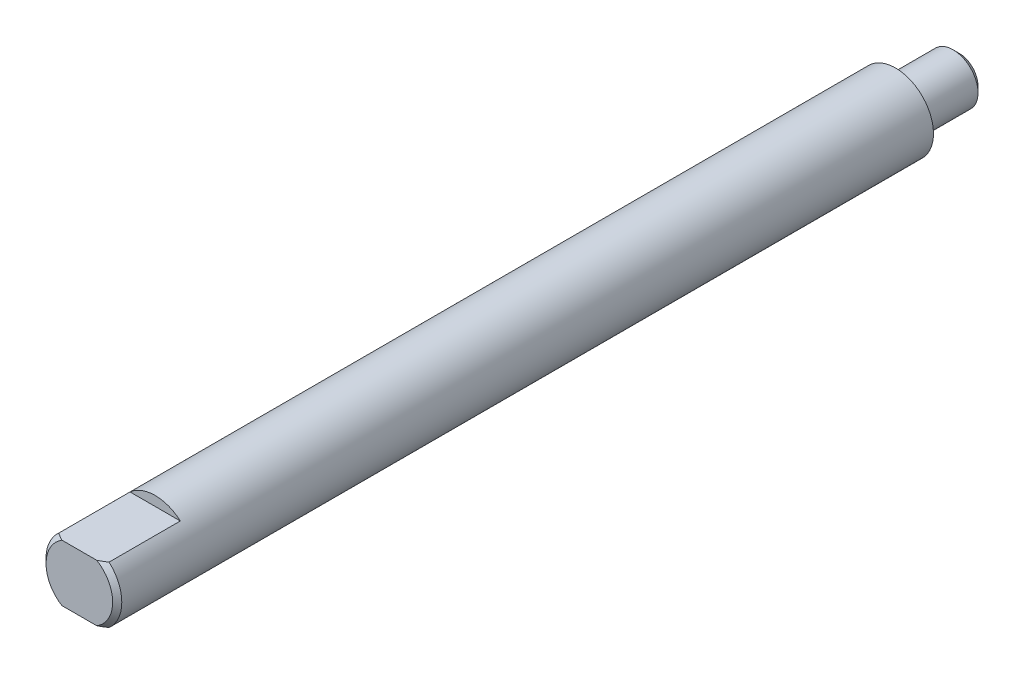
ISO-10303-21;
HEADER;
FILE_DESCRIPTION(('STEP AP214'),'2;1');
FILE_NAME('part.step','',(''),(''),'','','');
FILE_SCHEMA(('AUTOMOTIVE_DESIGN { 1 0 10303 214 1 1 1 1 }'));
ENDSEC;
DATA;
#1=APPLICATION_CONTEXT('core data for automotive mechanical design processes');
#2=APPLICATION_PROTOCOL_DEFINITION('international standard','automotive_design',2000,#1);
#3=PRODUCT_CONTEXT('',#1,'mechanical');
#4=PRODUCT('Part','Part','',(#3));
#5=PRODUCT_RELATED_PRODUCT_CATEGORY('part','',(#4));
#6=PRODUCT_DEFINITION_FORMATION('','',#4);
#7=PRODUCT_DEFINITION_CONTEXT('part definition',#1,'design');
#8=PRODUCT_DEFINITION('design','',#6,#7);
#9=PRODUCT_DEFINITION_SHAPE('','',#8);
#10=(LENGTH_UNIT() NAMED_UNIT(*) SI_UNIT(.MILLI.,.METRE.));
#11=(NAMED_UNIT(*) PLANE_ANGLE_UNIT() SI_UNIT($,.RADIAN.));
#12=(NAMED_UNIT(*) SI_UNIT($,.STERADIAN.) SOLID_ANGLE_UNIT());
#13=UNCERTAINTY_MEASURE_WITH_UNIT(LENGTH_MEASURE(1.E-05),#10,'distance_accuracy_value','');
#14=(GEOMETRIC_REPRESENTATION_CONTEXT(3) GLOBAL_UNCERTAINTY_ASSIGNED_CONTEXT((#13)) GLOBAL_UNIT_ASSIGNED_CONTEXT((#10,
#11,#12)) REPRESENTATION_CONTEXT('',''));
#15=CARTESIAN_POINT('',(0.,0.,0.));
#16=DIRECTION('',(0.,0.,1.));
#17=DIRECTION('',(1.,0.,0.));
#18=AXIS2_PLACEMENT_3D('',#15,#16,#17);
#19=CARTESIAN_POINT('',(0.,0.,3.684));
#20=DIRECTION('',(0.,0.,-1.));
#21=DIRECTION('',(0.,1.,0.));
#22=AXIS2_PLACEMENT_3D('',#19,#20,#21);
#23=CONICAL_SURFACE('',#22,3.175,0.791934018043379);
#24=CARTESIAN_POINT('',(0.,0.,3.684));
#25=DIRECTION('',(0.,0.,1.));
#26=DIRECTION('',(0.,-1.,0.));
#27=AXIS2_PLACEMENT_3D('',#24,#25,#26);
#28=CIRCLE('',#27,3.175);
#29=CARTESIAN_POINT('',(-2.10713075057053,2.37500000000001,3.684));
#30=VERTEX_POINT('',#29);
#31=CARTESIAN_POINT('',(-2.10713075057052,-2.37500000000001,3.684));
#32=VERTEX_POINT('',#31);
#33=EDGE_CURVE('E105',#30,#32,#28,.T.);
#34=ORIENTED_EDGE('',*,*,#33,.T.);
#35=CARTESIAN_POINT('',(-6.62966945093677,-2.37500000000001,-0.13301595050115));
#36=CARTESIAN_POINT('',(-6.41872085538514,-2.37500000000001,0.0629362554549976));
#37=CARTESIAN_POINT('',(-6.20729327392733,-2.37500000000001,0.258380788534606));
#38=CARTESIAN_POINT('',(-5.78286017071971,-2.37500000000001,0.647887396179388));
#39=CARTESIAN_POINT('',(-5.56985352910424,-2.37500000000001,0.84194824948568));
#40=CARTESIAN_POINT('',(-5.13574053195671,-2.37500000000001,1.23363349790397));
#41=CARTESIAN_POINT('',(-4.91457904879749,-2.37500000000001,1.43119690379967));
#42=CARTESIAN_POINT('',(-4.46963283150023,-2.37500000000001,1.82304516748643));
#43=CARTESIAN_POINT('',(-4.24585006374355,-2.37500000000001,2.0173322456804));
#44=CARTESIAN_POINT('',(-3.90719638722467,-2.37500000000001,2.30510248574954));
#45=CARTESIAN_POINT('',(-3.79385459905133,-2.37500000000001,2.40038380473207));
#46=CARTESIAN_POINT('',(-3.56590809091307,-2.37500000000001,2.58942155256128));
#47=CARTESIAN_POINT('',(-3.45130340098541,-2.37500000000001,2.68317801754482));
#48=CARTESIAN_POINT('',(-3.22025369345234,-2.37500000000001,2.8689546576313));
#49=CARTESIAN_POINT('',(-3.10380502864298,-2.37500000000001,2.96097030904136));
#50=CARTESIAN_POINT('',(-2.86892224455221,-2.37500000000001,3.14241965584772));
#51=CARTESIAN_POINT('',(-2.75048831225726,-2.37500000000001,3.23185359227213));
#52=CARTESIAN_POINT('',(-2.51255729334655,-2.37500000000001,3.40617108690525));
#53=CARTESIAN_POINT('',(-2.39309165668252,-2.37500000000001,3.49109735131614));
#54=CARTESIAN_POINT('',(-2.15090508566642,-2.37500000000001,3.656342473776));
#55=CARTESIAN_POINT('',(-2.02818269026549,-2.37500000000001,3.73665921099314));
#56=CARTESIAN_POINT('',(-1.77912466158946,-2.37500000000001,3.89039659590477));
#57=CARTESIAN_POINT('',(-1.65280524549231,-2.37500000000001,3.96384327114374));
#58=CARTESIAN_POINT('',(-1.39512518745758,-2.37500000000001,4.10119391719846));
#59=CARTESIAN_POINT('',(-1.26377071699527,-2.37500000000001,4.16510912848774));
#60=CARTESIAN_POINT('',(-1.05701971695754,-2.37500000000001,4.25273595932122));
#61=CARTESIAN_POINT('',(-0.983728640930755,-2.37500000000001,4.28140199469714));
#62=CARTESIAN_POINT('',(-0.835356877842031,-2.37500000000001,4.33377721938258));
#63=CARTESIAN_POINT('',(-0.760275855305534,-2.37500000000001,4.35748547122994));
#64=CARTESIAN_POINT('',(-0.608898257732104,-2.37500000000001,4.39885359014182));
#65=CARTESIAN_POINT('',(-0.532610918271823,-2.37500000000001,4.41654679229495));
#66=CARTESIAN_POINT('',(-0.378780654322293,-2.37500000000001,4.44515427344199));
#67=CARTESIAN_POINT('',(-0.301238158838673,-2.37500000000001,4.45607082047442));
#68=CARTESIAN_POINT('',(-0.144559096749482,-2.37500000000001,4.47054748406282));
#69=CARTESIAN_POINT('',(-0.0654144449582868,-2.37500000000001,4.47402190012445));
#70=CARTESIAN_POINT('',(0.0928249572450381,-2.37500000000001,4.47312081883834));
#71=CARTESIAN_POINT('',(0.171919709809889,-2.37500000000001,4.46874568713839));
#72=CARTESIAN_POINT('',(0.329626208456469,-2.37500000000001,4.45241265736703));
#73=CARTESIAN_POINT('',(0.408234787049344,-2.37500000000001,4.44042470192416));
#74=CARTESIAN_POINT('',(0.56408615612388,-2.37500000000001,4.40957980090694));
#75=CARTESIAN_POINT('',(0.641328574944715,-2.37500000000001,4.39072101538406));
#76=CARTESIAN_POINT('',(0.827865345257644,-2.37500000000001,4.33746225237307));
#77=CARTESIAN_POINT('',(0.936246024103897,-2.37500000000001,4.29987709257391));
#78=CARTESIAN_POINT('',(1.14927492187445,-2.37500000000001,4.21535984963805));
#79=CARTESIAN_POINT('',(1.25392057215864,-2.37500000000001,4.16842147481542));
#80=CARTESIAN_POINT('',(1.46087103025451,-2.37500000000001,4.06709514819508));
#81=CARTESIAN_POINT('',(1.56313950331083,-2.37500000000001,4.01263383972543));
#82=CARTESIAN_POINT('',(1.71427099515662,-2.37500000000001,3.92703840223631));
#83=CARTESIAN_POINT('',(1.76426245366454,-2.37500000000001,3.89786057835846));
#84=CARTESIAN_POINT('',(1.86356372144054,-2.37500000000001,3.83837009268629));
#85=CARTESIAN_POINT('',(1.91287355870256,-2.37500000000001,3.80805747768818));
#86=CARTESIAN_POINT('',(2.07522042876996,-2.37500000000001,3.70601224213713));
#87=CARTESIAN_POINT('',(2.18692206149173,-2.37500000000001,3.63215349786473));
#88=CARTESIAN_POINT('',(2.4077231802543,-2.37500000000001,3.48062951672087));
#89=CARTESIAN_POINT('',(2.51682205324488,-2.37500000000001,3.40296339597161));
#90=CARTESIAN_POINT('',(2.73301390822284,-2.37500000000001,3.24473477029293));
#91=CARTESIAN_POINT('',(2.84010537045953,-2.37500000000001,3.16417019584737));
#92=CARTESIAN_POINT('',(3.0526172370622,-2.37500000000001,3.00086187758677));
#93=CARTESIAN_POINT('',(3.15803753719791,-2.37500000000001,2.91811799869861));
#94=CARTESIAN_POINT('',(3.47300086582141,-2.37500000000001,2.66679989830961));
#95=CARTESIAN_POINT('',(3.68051445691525,-2.37500000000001,2.49568568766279));
#96=CARTESIAN_POINT('',(4.09182405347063,-2.37500000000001,2.14926116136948));
#97=CARTESIAN_POINT('',(4.2956216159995,-2.37500000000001,1.97395267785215));
#98=CARTESIAN_POINT('',(4.67931232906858,-2.37500000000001,1.63905531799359));
#99=CARTESIAN_POINT('',(4.85946034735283,-2.37500000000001,1.47975783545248));
#100=CARTESIAN_POINT('',(5.21824582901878,-2.37500000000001,1.15942835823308));
#101=CARTESIAN_POINT('',(5.39688309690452,-2.37500000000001,0.998396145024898));
#102=CARTESIAN_POINT('',(5.75173692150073,-2.37500000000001,0.676174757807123));
#103=CARTESIAN_POINT('',(5.92796166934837,-2.37500000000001,0.514994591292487));
#104=CARTESIAN_POINT('',(6.27946145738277,-2.37500000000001,0.191659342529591));
#105=CARTESIAN_POINT('',(6.45473664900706,-2.37500000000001,0.0295044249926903));
#106=CARTESIAN_POINT('',(6.62966945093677,-2.37500000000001,-0.133015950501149));
#107=B_SPLINE_CURVE_WITH_KNOTS('',3,(#35,#36,#37,#38,#39,#40,#41,#42,#43,#44,#45,#46,#47,#48,
#49,#50,#51,#52,#53,#54,#55,#56,#57,#58,#59,#60,#61,#62,#63,#64,#65,#66,#67,#68,#69,#70,#71,#72,
#73,#74,#75,#76,#77,#78,#79,#80,#81,#82,#83,#84,#85,#86,#87,#88,#89,#90,#91,#92,#93,#94,#95,#96,
#97,#98,#99,#100,#101,#102,#103,#104,#105,#106),.UNSPECIFIED.,.F.,.F.,(4,2,2,2,2,2,2,2,2,2,2,2,
2,2,2,2,2,2,2,2,2,2,2,2,2,2,2,2,2,2,2,2,2,2,2,4),(0.,0.863760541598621,1.72820709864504,
2.6178487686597,3.50686109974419,3.95106286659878,4.39525409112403,4.84047397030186,
5.28565214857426,5.72530383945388,6.16515621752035,6.60326828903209,7.04085953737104,
7.27681206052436,7.51280915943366,7.74747620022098,7.98206465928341,8.21934033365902,
8.45660495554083,8.69481223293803,8.93308334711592,9.27660606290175,9.62036064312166,
9.96774119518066,10.1413805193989,10.3150126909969,10.7166254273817,11.1183318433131,
11.5203310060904,11.9223551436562,12.7291420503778,13.535582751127,14.2569976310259,
14.9785044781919,15.6949553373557,16.4112883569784),.UNSPECIFIED.);
#108=CARTESIAN_POINT('',(-1.4640611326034,-2.37500000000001,4.064));
#109=VERTEX_POINT('',#108);
#110=EDGE_CURVE('E128',#32,#109,#107,.T.);
#111=ORIENTED_EDGE('',*,*,#110,.T.);
#112=CARTESIAN_POINT('',(0.,0.,4.064));
#113=DIRECTION('',(0.,0.,1.));
#114=DIRECTION('',(0.,-1.,0.));
#115=AXIS2_PLACEMENT_3D('',#112,#113,#114);
#116=CIRCLE('',#115,2.79);
#117=CARTESIAN_POINT('',(-1.4640611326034,2.37500000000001,4.064));
#118=VERTEX_POINT('',#117);
#119=EDGE_CURVE('E115',#118,#109,#116,.T.);
#120=ORIENTED_EDGE('',*,*,#119,.F.);
#121=CARTESIAN_POINT('',(6.62966945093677,2.37500000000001,-0.133015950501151));
#122=CARTESIAN_POINT('',(6.41872085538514,2.37500000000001,0.0629362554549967));
#123=CARTESIAN_POINT('',(6.20729327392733,2.37500000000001,0.258380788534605));
#124=CARTESIAN_POINT('',(5.78286017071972,2.37500000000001,0.647887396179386));
#125=CARTESIAN_POINT('',(5.56985352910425,2.37500000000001,0.841948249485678));
#126=CARTESIAN_POINT('',(5.13574053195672,2.37500000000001,1.23363349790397));
#127=CARTESIAN_POINT('',(4.9145790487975,2.37500000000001,1.43119690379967));
#128=CARTESIAN_POINT('',(4.46963283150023,2.37500000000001,1.82304516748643));
#129=CARTESIAN_POINT('',(4.24585006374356,2.37500000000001,2.0173322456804));
#130=CARTESIAN_POINT('',(3.90719638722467,2.37500000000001,2.30510248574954));
#131=CARTESIAN_POINT('',(3.79385459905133,2.37500000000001,2.40038380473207));
#132=CARTESIAN_POINT('',(3.56590809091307,2.37500000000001,2.58942155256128));
#133=CARTESIAN_POINT('',(3.45130340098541,2.37500000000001,2.68317801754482));
#134=CARTESIAN_POINT('',(3.22025369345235,2.37500000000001,2.8689546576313));
#135=CARTESIAN_POINT('',(3.10380502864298,2.37500000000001,2.96097030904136));
#136=CARTESIAN_POINT('',(2.86892224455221,2.37500000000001,3.14241965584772));
#137=CARTESIAN_POINT('',(2.75048831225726,2.37500000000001,3.23185359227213));
#138=CARTESIAN_POINT('',(2.51255729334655,2.37500000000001,3.40617108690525));
#139=CARTESIAN_POINT('',(2.39309165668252,2.37500000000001,3.49109735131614));
#140=CARTESIAN_POINT('',(2.15090508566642,2.37500000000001,3.656342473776));
#141=CARTESIAN_POINT('',(2.02818269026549,2.37500000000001,3.73665921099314));
#142=CARTESIAN_POINT('',(1.77912466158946,2.37500000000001,3.89039659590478));
#143=CARTESIAN_POINT('',(1.65280524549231,2.37500000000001,3.96384327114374));
#144=CARTESIAN_POINT('',(1.39512518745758,2.37500000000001,4.10119391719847));
#145=CARTESIAN_POINT('',(1.26377071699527,2.37500000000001,4.16510912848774));
#146=CARTESIAN_POINT('',(1.05701971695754,2.37500000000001,4.25273595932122));
#147=CARTESIAN_POINT('',(0.983728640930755,2.37500000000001,4.28140199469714));
#148=CARTESIAN_POINT('',(0.835356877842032,2.37500000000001,4.33377721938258));
#149=CARTESIAN_POINT('',(0.760275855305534,2.37500000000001,4.35748547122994));
#150=CARTESIAN_POINT('',(0.608898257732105,2.37500000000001,4.39885359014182));
#151=CARTESIAN_POINT('',(0.532610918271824,2.37500000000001,4.41654679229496));
#152=CARTESIAN_POINT('',(0.378780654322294,2.37500000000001,4.44515427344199));
#153=CARTESIAN_POINT('',(0.301238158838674,2.37500000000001,4.45607082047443));
#154=CARTESIAN_POINT('',(0.144559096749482,2.37500000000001,4.47054748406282));
#155=CARTESIAN_POINT('',(0.065414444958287,2.37500000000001,4.47402190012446));
#156=CARTESIAN_POINT('',(-0.0928249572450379,2.37500000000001,4.47312081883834));
#157=CARTESIAN_POINT('',(-0.171919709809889,2.37500000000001,4.4687456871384));
#158=CARTESIAN_POINT('',(-0.329626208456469,2.37500000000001,4.45241265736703));
#159=CARTESIAN_POINT('',(-0.408234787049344,2.37500000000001,4.44042470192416));
#160=CARTESIAN_POINT('',(-0.56408615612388,2.37500000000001,4.40957980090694));
#161=CARTESIAN_POINT('',(-0.641328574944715,2.37500000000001,4.39072101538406));
#162=CARTESIAN_POINT('',(-0.827865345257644,2.37500000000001,4.33746225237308));
#163=CARTESIAN_POINT('',(-0.936246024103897,2.37500000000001,4.29987709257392));
#164=CARTESIAN_POINT('',(-1.14927492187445,2.37500000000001,4.21535984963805));
#165=CARTESIAN_POINT('',(-1.25392057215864,2.37500000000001,4.16842147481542));
#166=CARTESIAN_POINT('',(-1.46087103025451,2.37500000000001,4.06709514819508));
#167=CARTESIAN_POINT('',(-1.56313950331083,2.37500000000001,4.01263383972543));
#168=CARTESIAN_POINT('',(-1.71427099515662,2.37500000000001,3.92703840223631));
#169=CARTESIAN_POINT('',(-1.76426245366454,2.37500000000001,3.89786057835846));
#170=CARTESIAN_POINT('',(-1.86356372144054,2.37500000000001,3.83837009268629));
#171=CARTESIAN_POINT('',(-1.91287355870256,2.37500000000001,3.80805747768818));
#172=CARTESIAN_POINT('',(-2.07522042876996,2.37500000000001,3.70601224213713));
#173=CARTESIAN_POINT('',(-2.18692206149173,2.37500000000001,3.63215349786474));
#174=CARTESIAN_POINT('',(-2.4077231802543,2.37500000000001,3.48062951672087));
#175=CARTESIAN_POINT('',(-2.51682205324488,2.37500000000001,3.40296339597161));
#176=CARTESIAN_POINT('',(-2.73301390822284,2.37500000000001,3.24473477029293));
#177=CARTESIAN_POINT('',(-2.84010537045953,2.37500000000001,3.16417019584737));
#178=CARTESIAN_POINT('',(-3.0526172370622,2.37500000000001,3.00086187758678));
#179=CARTESIAN_POINT('',(-3.15803753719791,2.37500000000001,2.91811799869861));
#180=CARTESIAN_POINT('',(-3.47300086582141,2.37500000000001,2.66679989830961));
#181=CARTESIAN_POINT('',(-3.68051445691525,2.37500000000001,2.49568568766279));
#182=CARTESIAN_POINT('',(-4.09182405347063,2.37500000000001,2.14926116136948));
#183=CARTESIAN_POINT('',(-4.2956216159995,2.37500000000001,1.97395267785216));
#184=CARTESIAN_POINT('',(-4.67931232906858,2.37500000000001,1.63905531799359));
#185=CARTESIAN_POINT('',(-4.85946034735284,2.37500000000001,1.47975783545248));
#186=CARTESIAN_POINT('',(-5.21824582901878,2.37500000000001,1.15942835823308));
#187=CARTESIAN_POINT('',(-5.39688309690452,2.37500000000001,0.998396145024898));
#188=CARTESIAN_POINT('',(-5.75173692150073,2.37500000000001,0.676174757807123));
#189=CARTESIAN_POINT('',(-5.92796166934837,2.37500000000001,0.514994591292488));
#190=CARTESIAN_POINT('',(-6.27946145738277,2.37500000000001,0.191659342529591));
#191=CARTESIAN_POINT('',(-6.45473664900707,2.37500000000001,0.0295044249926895));
#192=CARTESIAN_POINT('',(-6.62966945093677,2.37500000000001,-0.133015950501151));
#193=B_SPLINE_CURVE_WITH_KNOTS('',3,(#121,#122,#123,#124,#125,#126,#127,#128,#129,#130,#131,
#132,#133,#134,#135,#136,#137,#138,#139,#140,#141,#142,#143,#144,#145,#146,#147,#148,#149,#150,
#151,#152,#153,#154,#155,#156,#157,#158,#159,#160,#161,#162,#163,#164,#165,#166,#167,#168,#169,
#170,#171,#172,#173,#174,#175,#176,#177,#178,#179,#180,#181,#182,#183,#184,#185,#186,#187,#188,
#189,#190,#191,#192),.UNSPECIFIED.,.F.,.F.,(4,2,2,2,2,2,2,2,2,2,2,2,2,2,2,2,2,2,2,2,2,2,2,2,2,2,
2,2,2,2,2,2,2,2,2,4),(0.,0.863760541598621,1.72820709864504,2.6178487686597,3.50686109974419,
3.95106286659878,4.39525409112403,4.84047397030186,5.28565214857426,5.72530383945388,
6.16515621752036,6.6032682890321,7.04085953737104,7.27681206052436,7.51280915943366,
7.74747620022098,7.98206465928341,8.21934033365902,8.45660495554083,8.69481223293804,
8.93308334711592,9.27660606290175,9.62036064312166,9.96774119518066,10.1413805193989,
10.3150126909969,10.7166254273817,11.1183318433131,11.5203310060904,11.9223551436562,
12.7291420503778,13.535582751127,14.2569976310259,14.9785044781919,15.6949553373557,
16.4112883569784),.UNSPECIFIED.);
#194=EDGE_CURVE('E129',#118,#30,#193,.T.);
#195=ORIENTED_EDGE('',*,*,#194,.T.);
#196=EDGE_LOOP('',(#34,#111,#120,#195));
#197=FACE_BOUND('',#196,.T.);
#198=ADVANCED_FACE('F33',(#197),#23,.T.);
#199=CARTESIAN_POINT('',(0.,0.,4.064));
#200=DIRECTION('',(0.,0.,-1.));
#201=DIRECTION('',(0.,1.,0.));
#202=AXIS2_PLACEMENT_3D('',#199,#200,#201);
#203=PLANE('',#202);
#204=ORIENTED_EDGE('',*,*,#119,.T.);
#205=DIRECTION('',(1.,0.,0.));
#206=VECTOR('',#205,1.);
#207=CARTESIAN_POINT('',(-5.,-2.37500000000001,4.064));
#208=LINE('',#207,#206);
#209=CARTESIAN_POINT('',(1.4640611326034,-2.37500000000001,4.064));
#210=VERTEX_POINT('',#209);
#211=EDGE_CURVE('E95',#109,#210,#208,.T.);
#212=ORIENTED_EDGE('',*,*,#211,.T.);
#213=CARTESIAN_POINT('',(1.4640611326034,2.37500000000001,4.064));
#214=VERTEX_POINT('',#213);
#215=EDGE_CURVE('E109',#210,#214,#116,.T.);
#216=ORIENTED_EDGE('',*,*,#215,.T.);
#217=DIRECTION('',(1.,0.,0.));
#218=VECTOR('',#217,1.);
#219=CARTESIAN_POINT('',(-5.,2.37500000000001,4.064));
#220=LINE('',#219,#218);
#221=EDGE_CURVE('E135',#118,#214,#220,.T.);
#222=ORIENTED_EDGE('',*,*,#221,.F.);
#223=EDGE_LOOP('',(#204,#212,#216,#222));
#224=FACE_BOUND('',#223,.T.);
#225=ADVANCED_FACE('F35',(#224),#203,.F.);
#226=ORIENTED_EDGE('',*,*,#215,.F.);
#227=CARTESIAN_POINT('',(2.10713075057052,-2.37500000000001,3.684));
#228=VERTEX_POINT('',#227);
#229=EDGE_CURVE('E94',#210,#228,#107,.T.);
#230=ORIENTED_EDGE('',*,*,#229,.T.);
#231=CARTESIAN_POINT('',(2.10713075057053,2.37500000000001,3.684));
#232=VERTEX_POINT('',#231);
#233=EDGE_CURVE('E101',#228,#232,#28,.T.);
#234=ORIENTED_EDGE('',*,*,#233,.T.);
#235=EDGE_CURVE('E132',#232,#214,#193,.T.);
#236=ORIENTED_EDGE('',*,*,#235,.T.);
#237=EDGE_LOOP('',(#226,#230,#234,#236));
#238=FACE_BOUND('',#237,.T.);
#239=ADVANCED_FACE('F144',(#238),#23,.T.);
#240=CARTESIAN_POINT('',(0.,0.,4.064));
#241=DIRECTION('',(0.,0.,1.));
#242=DIRECTION('',(0.,-1.,0.));
#243=AXIS2_PLACEMENT_3D('',#240,#241,#242);
#244=CYLINDRICAL_SURFACE('',#243,3.17499999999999);
#245=ORIENTED_EDGE('',*,*,#233,.F.);
#246=DIRECTION('',(0.,0.,1.));
#247=VECTOR('',#246,1.);
#248=CARTESIAN_POINT('',(2.10713075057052,-2.37500000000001,4.064));
#249=LINE('',#248,#247);
#250=CARTESIAN_POINT('',(2.10713075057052,-2.37500000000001,-2.286));
#251=VERTEX_POINT('',#250);
#252=EDGE_CURVE('E11',#228,#251,#249,.F.);
#253=ORIENTED_EDGE('',*,*,#252,.T.);
#254=CARTESIAN_POINT('',(0.,0.,-2.286));
#255=DIRECTION('',(0.,0.,-1.));
#256=DIRECTION('',(-1.,0.,0.));
#257=AXIS2_PLACEMENT_3D('',#254,#255,#256);
#258=CIRCLE('',#257,3.17499999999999);
#259=CARTESIAN_POINT('',(-2.10713075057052,-2.37500000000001,-2.286));
#260=VERTEX_POINT('',#259);
#261=EDGE_CURVE('E85',#251,#260,#258,.T.);
#262=ORIENTED_EDGE('',*,*,#261,.T.);
#263=DIRECTION('',(0.,0.,1.));
#264=VECTOR('',#263,1.);
#265=CARTESIAN_POINT('',(-2.10713075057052,-2.37500000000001,4.064));
#266=LINE('',#265,#264);
#267=EDGE_CURVE('E41',#260,#32,#266,.T.);
#268=ORIENTED_EDGE('',*,*,#267,.T.);
#269=ORIENTED_EDGE('',*,*,#33,.F.);
#270=DIRECTION('',(0.,0.,1.));
#271=VECTOR('',#270,1.);
#272=CARTESIAN_POINT('',(-2.10713075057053,2.37500000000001,4.064));
#273=LINE('',#272,#271);
#274=CARTESIAN_POINT('',(-2.10713075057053,2.37500000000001,-2.286));
#275=VERTEX_POINT('',#274);
#276=EDGE_CURVE('E118',#30,#275,#273,.F.);
#277=ORIENTED_EDGE('',*,*,#276,.T.);
#278=CARTESIAN_POINT('',(0.,0.,-2.286));
#279=DIRECTION('',(0.,0.,-1.));
#280=DIRECTION('',(-1.,0.,0.));
#281=AXIS2_PLACEMENT_3D('',#278,#279,#280);
#282=CIRCLE('',#281,3.17499999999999);
#283=CARTESIAN_POINT('',(2.10713075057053,2.37500000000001,-2.286));
#284=VERTEX_POINT('',#283);
#285=EDGE_CURVE('E121',#275,#284,#282,.T.);
#286=ORIENTED_EDGE('',*,*,#285,.T.);
#287=DIRECTION('',(0.,0.,1.));
#288=VECTOR('',#287,1.);
#289=CARTESIAN_POINT('',(2.10713075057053,2.37500000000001,4.064));
#290=LINE('',#289,#288);
#291=EDGE_CURVE('E89',#284,#232,#290,.T.);
#292=ORIENTED_EDGE('',*,*,#291,.T.);
#293=EDGE_LOOP('',(#245,#253,#262,#268,#269,#277,#286,#292));
#294=FACE_BOUND('',#293,.T.);
#295=CARTESIAN_POINT('',(0.,0.,-64.3128));
#296=DIRECTION('',(0.,0.,1.));
#297=DIRECTION('',(0.,-1.,0.));
#298=AXIS2_PLACEMENT_3D('',#295,#296,#297);
#299=CIRCLE('',#298,3.17499999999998);
#300=CARTESIAN_POINT('',(0.,-3.17499999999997,-64.3128));
#301=VERTEX_POINT('',#300);
#302=EDGE_CURVE('E106',#301,#301,#299,.T.);
#303=ORIENTED_EDGE('',*,*,#302,.T.);
#304=EDGE_LOOP('',(#303));
#305=FACE_BOUND('',#304,.T.);
#306=ADVANCED_FACE('F98',(#294,#305),#244,.T.);
#307=CARTESIAN_POINT('',(0.,2.08280000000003,-64.3128));
#308=DIRECTION('',(0.,0.,1.));
#309=DIRECTION('',(0.,-1.,0.));
#310=AXIS2_PLACEMENT_3D('',#307,#308,#309);
#311=PLANE('',#310);
#312=ORIENTED_EDGE('',*,*,#302,.F.);
#313=EDGE_LOOP('',(#312));
#314=FACE_BOUND('',#313,.T.);
#315=CARTESIAN_POINT('',(0.,0.,-64.3128));
#316=DIRECTION('',(0.,0.,1.));
#317=DIRECTION('',(0.,-1.,0.));
#318=AXIS2_PLACEMENT_3D('',#315,#316,#317);
#319=CIRCLE('',#318,2.08280000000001);
#320=CARTESIAN_POINT('',(0.,-2.08279999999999,-64.3128));
#321=VERTEX_POINT('',#320);
#322=EDGE_CURVE('E111',#321,#321,#319,.T.);
#323=ORIENTED_EDGE('',*,*,#322,.T.);
#324=EDGE_LOOP('',(#323));
#325=FACE_BOUND('',#324,.T.);
#326=ADVANCED_FACE('F165',(#314,#325),#311,.F.);
#327=CARTESIAN_POINT('',(0.,0.,4.064));
#328=DIRECTION('',(0.,0.,1.));
#329=DIRECTION('',(0.,-1.,0.));
#330=AXIS2_PLACEMENT_3D('',#327,#328,#329);
#331=CYLINDRICAL_SURFACE('',#330,2.08280000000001);
#332=ORIENTED_EDGE('',*,*,#322,.F.);
#333=EDGE_LOOP('',(#332));
#334=FACE_BOUND('',#333,.T.);
#335=CARTESIAN_POINT('',(0.,0.,-69.1368));
#336=DIRECTION('',(0.,0.,1.));
#337=DIRECTION('',(0.,-1.,0.));
#338=AXIS2_PLACEMENT_3D('',#335,#336,#337);
#339=CIRCLE('',#338,2.08280000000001);
#340=CARTESIAN_POINT('',(0.,-2.08279999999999,-69.1368));
#341=VERTEX_POINT('',#340);
#342=EDGE_CURVE('E263',#341,#341,#339,.T.);
#343=ORIENTED_EDGE('',*,*,#342,.T.);
#344=EDGE_LOOP('',(#343));
#345=FACE_BOUND('',#344,.T.);
#346=ADVANCED_FACE('F161',(#334,#345),#331,.T.);
#347=CARTESIAN_POINT('',(0.,0.,-69.6468));
#348=DIRECTION('',(0.,0.,1.));
#349=DIRECTION('',(0.,-1.,0.));
#350=AXIS2_PLACEMENT_3D('',#347,#348,#349);
#351=CONICAL_SURFACE('',#350,1.57,0.788135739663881);
#352=ORIENTED_EDGE('',*,*,#342,.F.);
#353=EDGE_LOOP('',(#352));
#354=FACE_BOUND('',#353,.T.);
#355=CARTESIAN_POINT('',(0.,0.,-69.6468));
#356=DIRECTION('',(0.,0.,1.));
#357=DIRECTION('',(0.,-1.,0.));
#358=AXIS2_PLACEMENT_3D('',#355,#356,#357);
#359=CIRCLE('',#358,1.57);
#360=CARTESIAN_POINT('',(0.,-1.56999999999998,-69.6468));
#361=VERTEX_POINT('',#360);
#362=EDGE_CURVE('E134',#361,#361,#359,.T.);
#363=ORIENTED_EDGE('',*,*,#362,.T.);
#364=EDGE_LOOP('',(#363));
#365=FACE_BOUND('',#364,.T.);
#366=ADVANCED_FACE('F157',(#354,#365),#351,.T.);
#367=CARTESIAN_POINT('',(0.,0.,-69.6468));
#368=DIRECTION('',(0.,0.,1.));
#369=DIRECTION('',(0.,-1.,0.));
#370=AXIS2_PLACEMENT_3D('',#367,#368,#369);
#371=PLANE('',#370);
#372=ORIENTED_EDGE('',*,*,#362,.F.);
#373=EDGE_LOOP('',(#372));
#374=FACE_BOUND('',#373,.T.);
#375=ADVANCED_FACE('F154',(#374),#371,.F.);
#376=CARTESIAN_POINT('',(-5.,2.37500000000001,-2.286));
#377=DIRECTION('',(0.,0.,-1.));
#378=DIRECTION('',(-1.,0.,0.));
#379=AXIS2_PLACEMENT_3D('',#376,#377,#378);
#380=PLANE('',#379);
#381=DIRECTION('',(1.,0.,0.));
#382=VECTOR('',#381,1.);
#383=CARTESIAN_POINT('',(-5.,2.37500000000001,-2.286));
#384=LINE('',#383,#382);
#385=EDGE_CURVE('E55',#275,#284,#384,.T.);
#386=ORIENTED_EDGE('',*,*,#385,.T.);
#387=ORIENTED_EDGE('',*,*,#285,.F.);
#388=EDGE_LOOP('',(#386,#387));
#389=FACE_BOUND('',#388,.T.);
#390=ADVANCED_FACE('F152',(#389),#380,.F.);
#391=CARTESIAN_POINT('',(-5.,2.37500000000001,4.064));
#392=DIRECTION('',(0.,-1.,0.));
#393=DIRECTION('',(0.,0.,-1.));
#394=AXIS2_PLACEMENT_3D('',#391,#392,#393);
#395=PLANE('',#394);
#396=ORIENTED_EDGE('',*,*,#291,.F.);
#397=ORIENTED_EDGE('',*,*,#385,.F.);
#398=ORIENTED_EDGE('',*,*,#276,.F.);
#399=ORIENTED_EDGE('',*,*,#194,.F.);
#400=ORIENTED_EDGE('',*,*,#221,.T.);
#401=ORIENTED_EDGE('',*,*,#235,.F.);
#402=EDGE_LOOP('',(#396,#397,#398,#399,#400,#401));
#403=FACE_BOUND('',#402,.T.);
#404=ADVANCED_FACE('F147',(#403),#395,.F.);
#405=CARTESIAN_POINT('',(-5.,-2.37500000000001,4.064));
#406=DIRECTION('',(0.,1.,0.));
#407=DIRECTION('',(0.,0.,1.));
#408=AXIS2_PLACEMENT_3D('',#405,#406,#407);
#409=PLANE('',#408);
#410=ORIENTED_EDGE('',*,*,#267,.F.);
#411=DIRECTION('',(1.,0.,0.));
#412=VECTOR('',#411,1.);
#413=CARTESIAN_POINT('',(-5.,-2.37500000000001,-2.286));
#414=LINE('',#413,#412);
#415=EDGE_CURVE('E47',#260,#251,#414,.T.);
#416=ORIENTED_EDGE('',*,*,#415,.T.);
#417=ORIENTED_EDGE('',*,*,#252,.F.);
#418=ORIENTED_EDGE('',*,*,#229,.F.);
#419=ORIENTED_EDGE('',*,*,#211,.F.);
#420=ORIENTED_EDGE('',*,*,#110,.F.);
#421=EDGE_LOOP('',(#410,#416,#417,#418,#419,#420));
#422=FACE_BOUND('',#421,.T.);
#423=ADVANCED_FACE('F92',(#422),#409,.F.);
#424=CARTESIAN_POINT('',(-5.,-2.37500000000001,-2.286));
#425=DIRECTION('',(0.,0.,-1.));
#426=DIRECTION('',(-1.,0.,0.));
#427=AXIS2_PLACEMENT_3D('',#424,#425,#426);
#428=PLANE('',#427);
#429=ORIENTED_EDGE('',*,*,#415,.F.);
#430=ORIENTED_EDGE('',*,*,#261,.F.);
#431=EDGE_LOOP('',(#429,#430));
#432=FACE_BOUND('',#431,.T.);
#433=ADVANCED_FACE('F86',(#432),#428,.F.);
#434=CLOSED_SHELL('',(#198,#225,#239,#306,#326,#346,#366,#375,#390,#404,#423,#433));
#435=MANIFOLD_SOLID_BREP('B2',#434);
#436=ADVANCED_BREP_SHAPE_REPRESENTATION('',(#18,#435),#14);
#437=SHAPE_DEFINITION_REPRESENTATION(#9,#436);
ENDSEC;
END-ISO-10303-21;
